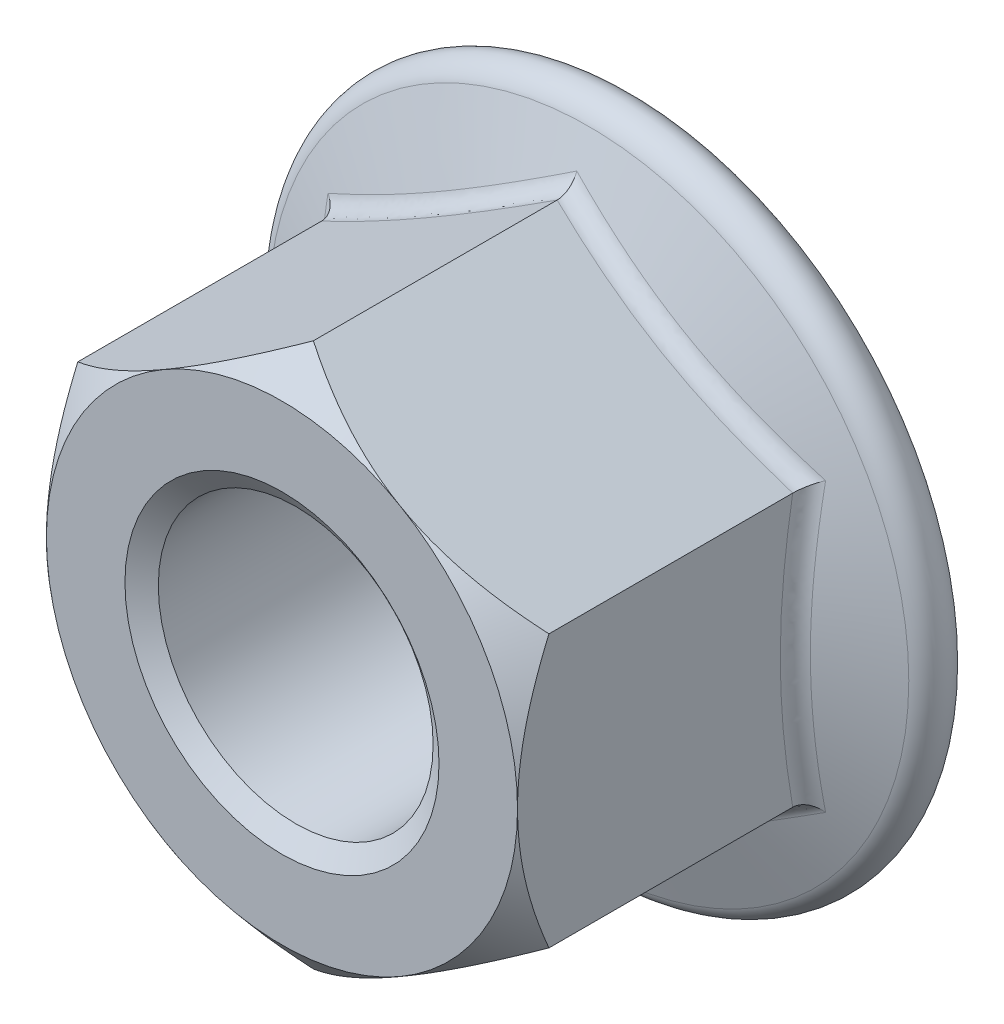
from build123d import *

# Parameters (mm, degrees)
BASENUTSKE_R   = 8.75
BASENUT_DEPTH  = 22.5298
FLANGEFILLET_R = 1.2


with BuildPart() as part:
    # BaseNutSke → BaseNut (new body)
    with BuildSketch(Plane.XY):
        Polygon((15, 8.660254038), (15, -8.660254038), (0, -17.320508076), (-15, -8.660254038), (-15, 8.660254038), (0, 17.320508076), align=None)
        Circle(BASENUTSKE_R, mode=Mode.SUBTRACT)
    extrude(amount=-BASENUT_DEPTH)

    # Sketch6 → Flange (revolve)
    with BuildSketch(Plane(origin=(0, 0, 0), x_dir=(0, 0, -1), z_dir=(1, 0, 0)), mode=Mode.PRIVATE) as flange_sk:
        with BuildLine():
            Line((15.29597298, 8.75), (19.5298, 20.382344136))
            ThreePointArc((19.5298, 20.382344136), (21.251733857, 21.376503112), (22.5298, 19.853363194))
            Line((22.5298, 19.853363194), (22.5298, 8.75))
            Line((22.5298, 8.75), (15.29597298, 8.75))
        make_face()
    revolve(flange_sk.sketch.rotate(Axis((0, 0, 0), (0, 0, -1)), 90), axis=Axis((0, 0, 0), (0, 0, -1)))

    # Sketch3 → Double-Chamfer (revolve, cut)
    with BuildSketch(Plane(origin=(0, 0, 0), x_dir=(0, 0, -1), z_dir=(1, 0, 0)), mode=Mode.PRIVATE) as double_chamfer_sk:
        Polygon((2, 30.020508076), (-12.7, 30.020508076), (-12.7, 15), (0, 15), (2, 17.320508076), align=None)
    revolve(double_chamfer_sk.sketch.rotate(Axis((0, 0, 0), (0, 0, -1)), 239.999999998), axis=Axis((0, 0, 0), (0, 0, -1)), mode=Mode.SUBTRACT)

    # FlangeFillet
    flangefillet_edges = [part.edges().sort_by_distance(p)[0] for p in [
        (15, -4.349016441, -17.795627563),
        (15, 4.349016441, -17.795627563),
        (-7.5, 12.990381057, -17.570786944),
        (-15, 0, -17.570786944),
        (-7.5, -12.990381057, -17.570786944),
        (7.5, 12.990381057, -17.570786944),
        (7.5, -12.990381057, -17.570786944),
    ]]
    fillet(flangefillet_edges, radius=FLANGEFILLET_R)

    # Sketch5 (on Right Plane) → EndChamfer (revolve, cut)
    with BuildSketch(Plane(origin=(0, 0, 0), x_dir=(0, 0, -1), z_dir=(1, 0, 0)), mode=Mode.PRIVATE) as endchamfer_sk:
        Polygon((22.5044, 10), (21.541614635, 8.625), (22.5552, 8.625), (22.5552, 10), align=None)
        Polygon((-0.0508, 10), (0, 10), (0.962785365, 8.625), (-0.0508, 8.625), align=None)
    revolve(endchamfer_sk.sketch.rotate(Axis((0, 0, -25.037505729), (0, 0, -1)), 90), axis=Axis((0, 0, -25.037505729), (0, 0, -1)), mode=Mode.SUBTRACT)


solid = part.part
